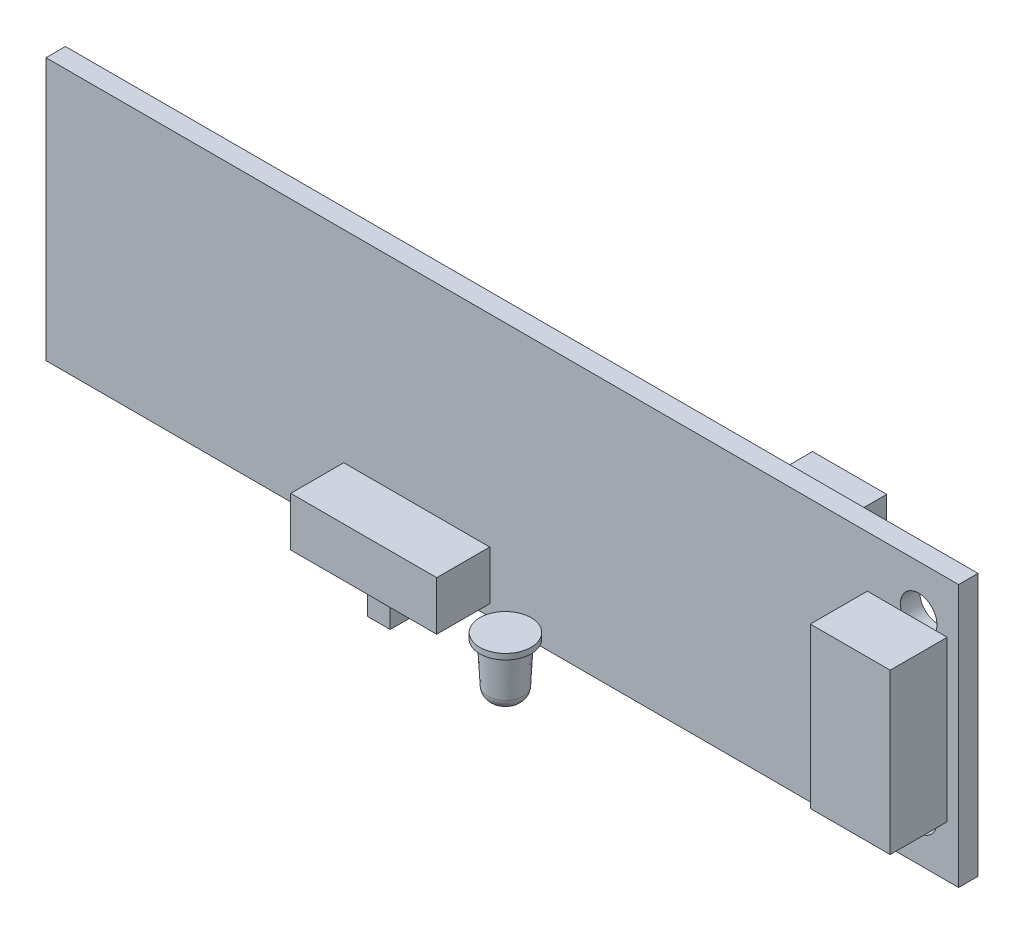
from build123d import *

# Parameters (mm, degrees)
ESQUISSE1_W             = 80
ESQUISSE1_H             = 23
BOSS_EXTRU_1_DEPTH      = 1.7
ENL_V_MAT_EXTRU_1_REACH = 43.655
ESQUISSE2_R             = 1.6
ESQUISSE3_W             = 12.8
ESQUISSE3_H             = 4.3
BOSS_EXTRU_2_DEPTH      = 4.65
ESQUISSE4_W             = 6.5
ESQUISSE4_H             = 13
BOSS_EXTRU_3_DEPTH      = 1
ESQUISSE5_W             = 6.5
ESQUISSE5_H             = 4
BOSS_EXTRU_4_DEPTH      = 6
ESQUISSE6_R             = 1.75
BOSS_EXTRU_5_DEPTH      = 4.5
BOSS_EXTRU_5_TAPER      = 3
ESQUISSE7_R             = 2.25
BOSS_EXTRU_6_DEPTH      = 0.5
CONG_1_R                = 1
ESQUISSE8_W             = 2
ESQUISSE8_H             = 2
BOSS_EXTRU_7_DEPTH      = 3
ESQUISSE9_W             = 7
ESQUISSE9_H             = 14
BOSS_EXTRU_8_DEPTH      = 5


with BuildPart() as part:
    # Esquisse1 → Boss.-Extru.1 (new body)
    with BuildSketch(Plane.XY):
        Rectangle(ESQUISSE1_W, ESQUISSE1_H)
    extrude(amount=BOSS_EXTRU_1_DEPTH)

    # Esquisse2 → Enl_v. mat.-Extru.1 (cut, up to next)
    with BuildSketch(Plane.XY.offset(1.7), mode=Mode.PRIVATE) as enl_v_mat_extru_1_sk1:
        with Locations((36.5, 7.5)):
            Circle(ESQUISSE2_R)
    enl_v_mat_extru_1_tool1 = extrude(enl_v_mat_extru_1_sk1.sketch, amount=-ENL_V_MAT_EXTRU_1_REACH, mode=Mode.PRIVATE) & part.part
    # Esquisse2 → Enl_v. mat.-Extru.1 (cut, up to next)
    with BuildSketch(Plane.XY.offset(1.7), mode=Mode.PRIVATE) as enl_v_mat_extru_1_sk2:
        with Locations((36.5, -7.5)):
            Circle(ESQUISSE2_R)
    enl_v_mat_extru_1_tool2 = extrude(enl_v_mat_extru_1_sk2.sketch, amount=-ENL_V_MAT_EXTRU_1_REACH, mode=Mode.PRIVATE) & part.part
    add(enl_v_mat_extru_1_tool1.solids().sort_by_distance((36.5, 7.5, 1.7))[0], mode=Mode.SUBTRACT)
    add(enl_v_mat_extru_1_tool2.solids().sort_by_distance((36.5, -7.5, 1.7))[0], mode=Mode.SUBTRACT)

    # Esquisse3 → Boss.-Extru.2 (add)
    with BuildSketch(Plane.XY.offset(1.7)):
        with Locations((-7.5, -8.35)):
            Rectangle(ESQUISSE3_W, ESQUISSE3_H)
    extrude(amount=BOSS_EXTRU_2_DEPTH)

    # Esquisse4 → Boss.-Extru.3 (add)
    with BuildSketch(Plane(origin=(0, 0, 0), x_dir=(-1, 0, 0), z_dir=(0, 0, -1))):
        with Locations((-21.75, 0)):
            Rectangle(ESQUISSE4_W, ESQUISSE4_H)
    extrude(amount=BOSS_EXTRU_3_DEPTH)

    # Esquisse5 → Boss.-Extru.4 (add)
    with BuildSketch(Plane(origin=(0, 0, -1), x_dir=(-1, 0, 0), z_dir=(0, 0, -1))):
        with Locations((-21.75, -4.5)):
            Rectangle(ESQUISSE5_W, ESQUISSE5_H)
        with Locations((-21.75, 4.5)):
            Rectangle(ESQUISSE5_W, ESQUISSE5_H)
    extrude(amount=BOSS_EXTRU_4_DEPTH)

    # Esquisse8 → Boss.-Extru.7 (add)
    with BuildSketch(Plane.XZ.offset(10.5)):
        with Locations((-7.5, 4.025)):
            Rectangle(ESQUISSE8_W, ESQUISSE8_H)
    extrude(amount=BOSS_EXTRU_7_DEPTH)

    # Esquisse9 → Boss.-Extru.8 (add)
    with BuildSketch(Plane.XY.offset(1.7)):
        with Locations((35.5, 0)):
            Rectangle(ESQUISSE9_W, ESQUISSE9_H)
    extrude(amount=BOSS_EXTRU_8_DEPTH)


with BuildPart() as body_2:
    # Esquisse6 → Boss.-Extru.5 (new body)
    with BuildSketch(Plane(origin=(0, -9.5, 0), x_dir=(-1, 0, 0), z_dir=(0, -1, 0))):
        with Locations((-3.275, -4.7)):
            Circle(ESQUISSE6_R)
    extrude(amount=BOSS_EXTRU_5_DEPTH, taper=BOSS_EXTRU_5_TAPER)

    # Esquisse7 → Boss.-Extru.6 (add)
    with BuildSketch(Plane(origin=(0, -9.5, 0), x_dir=(1, 0, 0), z_dir=(0, 1, 0))):
        with Locations(Location((3.275, -4.7, 0), (0, 0, 270))):
            Circle(ESQUISSE7_R)
    extrude(amount=BOSS_EXTRU_6_DEPTH)

    # Cong_1
    cong_1_edges = [body_2.edges().sort_by_distance(p)[0] for p in [
        (4.789164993, -14, 4.7),
    ]]
    fillet(cong_1_edges, radius=CONG_1_R)


solid = Compound([part.part, body_2.part])
